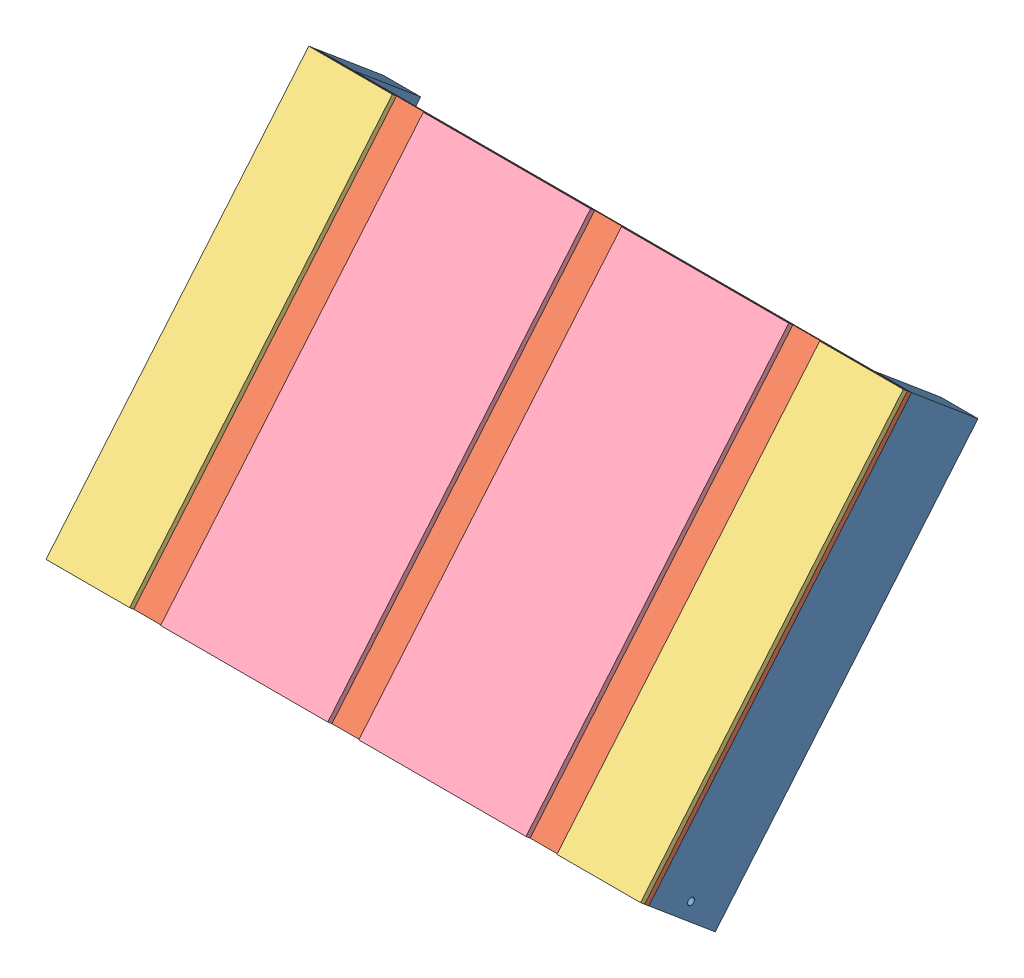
SolidWorks assembly TE-25007.SLDASM, configuration Default (file format 15000). Lengths in mm.
Overall size (609.6 385.34 346.01).
7 component instances, 4 part files, 18 mates.
Components (placement in the parent):
- TE-25008-1: TE-25008.SLDPRT [Default] at (288.6268 1261.0748 -66.1815) x (0 -0.766044 0.642788) z (-1 0 0) size (419.1 88.9 38.1)
- TE-25008-2: TE-25008.SLDPRT [Default] at (860.1268 1261.0748 -66.1815) x (0 -0.766044 0.642788) z (-1 0 0) size (419.1 88.9 38.1)
- TE-25009-1: TE-25009.SLDPRT [Default] at (555.3268 1157.694 136.616) x (1 0 0) z (0 -0.766044 0.642788) size (609.6 5.56 419.1)
- TE-25012-1: TE-25012.SLDPRT [Default] at (293.3893 1161.2655 140.8723) x (1 0 0) z (0 -0.766044 0.642788) size (85.72 5.56 419.1)
- TE-25012-2: TE-25012.SLDPRT [Default] at (817.2643 1161.2655 140.8723) x (1 0 0) z (0 -0.766044 0.642788) size (85.72 5.56 419.1)
- TE-25011-3: TE-25011.SLDPRT [Default] at (453.7268 1161.2655 140.8723) x (1 0 0) z (0 -0.766044 0.642788) size (171.45 5.56 419.1)
- TE-25011-4: TE-25011.SLDPRT [Default] at (656.9268 1161.2655 140.8723) x (1 0 0) z (0 -0.766044 0.642788) size (171.45 5.56 419.1)
Mates (geometry in assembly coordinates):
- Coincident31: coincident anti-aligned: plane of TE-25008-1 through (250.5268 1318.2186 1.9199) normal (0 0.642788 0.766044); plane of TE-25009-1 through (555.3268 1157.694 136.616) normal (0 -0.642788 -0.766044)
- Coincident32: coincident aligned: plane of TE-25008-1 through (250.5268 1261.0748 -66.1815) normal (-1 0 0); plane of TE-25009-1 through (250.5268 1000.7408 275.5685) normal (-1 0 0)
- Coincident44: coincident aligned: plane of TE-25008-1 through (250.5268 1261.0748 -66.1815) normal (0 0.766044 -0.642788); plane of TE-25009-1 through (250.5268 1321.7901 6.1762) normal (0 0.766044 -0.642788)
- Coincident34: coincident aligned: plane of TE-25008-2 through (860.1268 1261.0748 -66.1815) normal (1 0 0); plane of TE-25009-1 through (860.1268 1000.7408 275.5685) normal (1 0 0)
- Coincident35: coincident anti-aligned: plane of TE-25008-2 through (822.0268 1318.2186 1.9199) normal (0 0.642788 0.766044); plane of TE-25009-1 through (555.3268 1157.694 136.616) normal (0 -0.642788 -0.766044)
- Coincident45: coincident aligned: plane of TE-25008-2 through (822.0268 1261.0748 -66.1815) normal (0 0.766044 -0.642788); plane of TE-25009-1 through (250.5268 1321.7901 6.1762) normal (0 0.766044 -0.642788)
- Coincident46: coincident anti-aligned: plane of TE-25009-1 through (555.3268 1161.2655 140.8723) normal (0 0.642788 0.766044); plane of TE-25012-1 through (293.3893 1161.2655 140.8723) normal (0 -0.642788 -0.766044)
- Coincident47: coincident anti-aligned: plane of TE-25009-1 through (555.3268 1161.2655 140.8723) normal (0 0.642788 0.766044); plane of TE-25012-2 through (817.2643 1161.2655 140.8723) normal (0 -0.642788 -0.766044)
- Coincident48: coincident aligned: plane of TE-25009-1 through (250.5268 1000.7408 275.5685) normal (0 -0.766044 0.642788); plane of TE-25012-1 through (250.5268 1004.3123 279.8248) normal (0 -0.766044 0.642788)
- Coincident49: coincident aligned: plane of TE-25009-1 through (250.5268 1000.7408 275.5685) normal (0 -0.766044 0.642788); plane of TE-25012-2 through (774.4018 1004.3123 279.8248) normal (0 -0.766044 0.642788)
- Coincident51: coincident anti-aligned: plane of TE-25009-1 through (555.3268 1161.2655 140.8723) normal (0 0.642788 0.766044); plane of TE-25011-3 through (453.7268 1161.2655 140.8723) normal (0 -0.642788 -0.766044)
- Coincident52: coincident anti-aligned: plane of TE-25009-1 through (555.3268 1161.2655 140.8723) normal (0 0.642788 0.766044); plane of TE-25011-4 through (656.9268 1161.2655 140.8723) normal (0 -0.642788 -0.766044)
- Coincident53: coincident aligned: plane of TE-25009-1 through (250.5268 1000.7408 275.5685) normal (0 -0.766044 0.642788); plane of TE-25011-3 through (368.0018 1004.3123 279.8248) normal (0 -0.766044 0.642788)
- Coincident54: coincident aligned: plane of TE-25009-1 through (250.5268 1000.7408 275.5685) normal (0 -0.766044 0.642788); plane of TE-25011-4 through (571.2018 1004.3123 279.8248) normal (0 -0.766044 0.642788)
- Distance2: distance = 31.75 mm anti-aligned: plane of TE-25011-4 through (571.2018 1325.3616 10.4325) normal (-1 0 0); plane of TE-25011-3 through (539.4518 1325.3616 10.4325) normal (1 0 0)
- Distance3: distance = 31.75 mm anti-aligned: plane of TE-25011-4 through (742.6518 1325.3616 10.4325) normal (1 0 0); plane of TE-25012-2 through (774.4018 1325.3616 10.4325) normal (-1 0 0)
- Distance4: distance = 31.75 mm anti-aligned: plane of TE-25011-3 through (368.0018 1325.3616 10.4325) normal (-1 0 0); plane of TE-25012-1 through (336.2518 1325.3616 10.4325) normal (1 0 0)
- Coincident58: coincident aligned: plane of TE-25009-1 through (250.5268 1000.7408 275.5685) normal (-1 0 0); plane of TE-25012-1 through (250.5268 1325.3616 10.4325) normal (-1 0 0)
